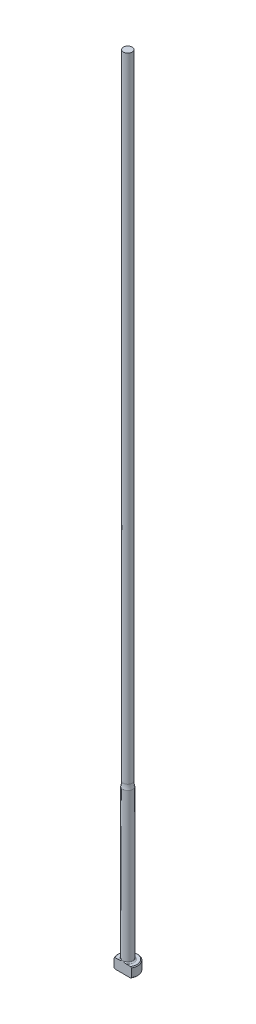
from build123d import *

# Parameters (mm, degrees)
CHAMFER1_SIZE      = 0.254
FILLET1_R          = 0.381
CUT_EXTRUDE1_DEPTH = 255.0396844


with BuildPart() as part:
    # Sketch1 → Revolve1 (revolve)
    with BuildSketch(Plane.XY, mode=Mode.PRIVATE) as revolve1_sk:
        with BuildLine():
            Line((0, 0), (-3.175, 0))
            Line((-3.175, 0), (-3.175, 3.175))
            Line((-3.175, 3.175), (-1.5875, 3.175))
            Line((-1.5875, 3.175), (-1.5875, 50.8))
            ThreePointArc((-1.5875, 50.8), (-1.438154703, 51.583111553), (-1.38811, 52.378764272))
            Line((-1.38811, 52.378764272), (-1.38811, 254))
            Line((-1.38811, 254), (0, 254))
            Line((0, 254), (0, 0))
        make_face()
    revolve(revolve1_sk.sketch.rotate(Axis((0, 259.958771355, 0), (0, -1, 0)), 270), axis=Axis((0, 259.958771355, 0), (0, -1, 0)))

    # Chamfer1
    chamfer1_edges = [part.edges().sort_by_distance(p)[0] for p in [
        (0, 0, -3.175),
        (0, 3.175, -3.175),
    ]]
    chamfer(chamfer1_edges, length=CHAMFER1_SIZE)

    # Fillet1
    fillet1_edges = [part.edges().sort_by_distance(p)[0] for p in [
        (0, 3.175, -1.5875),
    ]]
    fillet(fillet1_edges, radius=FILLET1_R)

    # Sketch2 → Cut-Extrude1 (cut, through all)
    with BuildSketch(Plane.XZ):
        with BuildLine():
            Line((-2.749630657, 1.5875), (2.749630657, 1.5875))
            ThreePointArc((2.749630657, 1.5875), (0, 3.175), (-2.749630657, 1.5875))
        make_face()
    extrude(amount=-CUT_EXTRUDE1_DEPTH, mode=Mode.SUBTRACT)


solid = part.part
